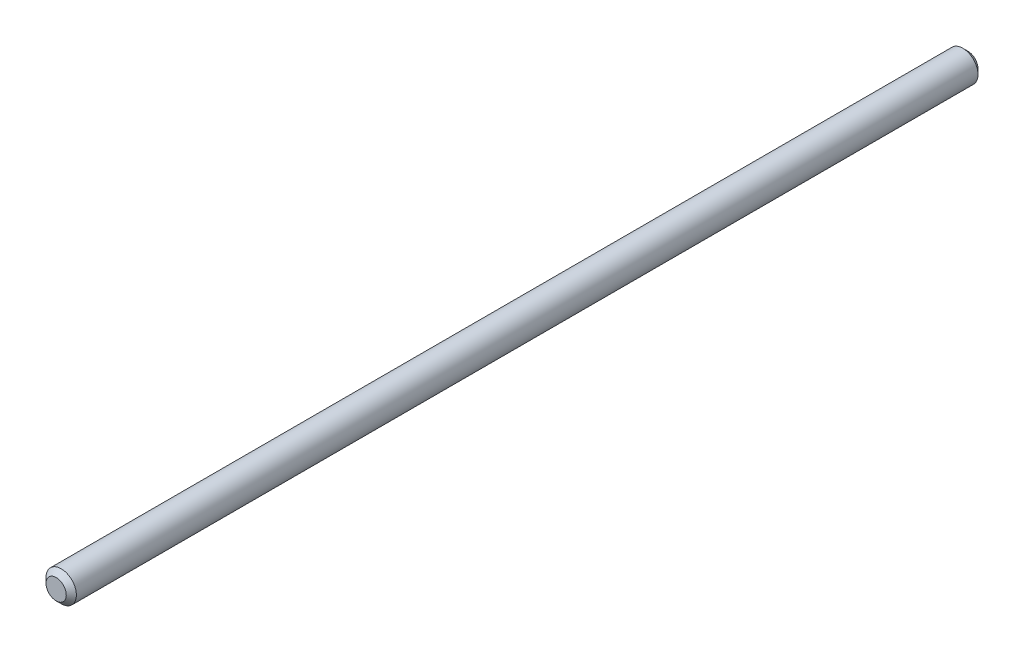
ISO-10303-21;
HEADER;
FILE_DESCRIPTION(('STEP AP214'),'2;1');
FILE_NAME('part.step','',(''),(''),'','','');
FILE_SCHEMA(('AUTOMOTIVE_DESIGN { 1 0 10303 214 1 1 1 1 }'));
ENDSEC;
DATA;
#1=APPLICATION_CONTEXT('core data for automotive mechanical design processes');
#2=APPLICATION_PROTOCOL_DEFINITION('international standard','automotive_design',2000,#1);
#3=PRODUCT_CONTEXT('',#1,'mechanical');
#4=PRODUCT('Part','Part','',(#3));
#5=PRODUCT_RELATED_PRODUCT_CATEGORY('part','',(#4));
#6=PRODUCT_DEFINITION_FORMATION('','',#4);
#7=PRODUCT_DEFINITION_CONTEXT('part definition',#1,'design');
#8=PRODUCT_DEFINITION('design','',#6,#7);
#9=PRODUCT_DEFINITION_SHAPE('','',#8);
#10=(LENGTH_UNIT() NAMED_UNIT(*) SI_UNIT(.MILLI.,.METRE.));
#11=(NAMED_UNIT(*) PLANE_ANGLE_UNIT() SI_UNIT($,.RADIAN.));
#12=(NAMED_UNIT(*) SI_UNIT($,.STERADIAN.) SOLID_ANGLE_UNIT());
#13=UNCERTAINTY_MEASURE_WITH_UNIT(LENGTH_MEASURE(1.E-05),#10,'distance_accuracy_value','');
#14=(GEOMETRIC_REPRESENTATION_CONTEXT(3) GLOBAL_UNCERTAINTY_ASSIGNED_CONTEXT((#13)) GLOBAL_UNIT_ASSIGNED_CONTEXT((#10,
#11,#12)) REPRESENTATION_CONTEXT('',''));
#15=CARTESIAN_POINT('',(0.,0.,0.));
#16=DIRECTION('',(0.,0.,1.));
#17=DIRECTION('',(1.,0.,0.));
#18=AXIS2_PLACEMENT_3D('',#15,#16,#17);
#19=CARTESIAN_POINT('',(0.,0.,90.));
#20=DIRECTION('',(0.,0.,-1.));
#21=DIRECTION('',(-1.,0.,0.));
#22=AXIS2_PLACEMENT_3D('',#19,#20,#21);
#23=CYLINDRICAL_SURFACE('',#22,1.5);
#24=CARTESIAN_POINT('',(0.,0.,89.5));
#25=DIRECTION('',(0.,0.,1.));
#26=DIRECTION('',(1.,0.,0.));
#27=AXIS2_PLACEMENT_3D('',#24,#25,#26);
#28=CIRCLE('',#27,1.5);
#29=CARTESIAN_POINT('',(-1.5,0.,89.5));
#30=VERTEX_POINT('',#29);
#31=EDGE_CURVE('E30',#30,#30,#28,.F.);
#32=CARTESIAN_POINT('',(0.,0.,0.500000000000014));
#33=DIRECTION('',(0.,0.,1.));
#34=DIRECTION('',(1.,0.,0.));
#35=AXIS2_PLACEMENT_3D('',#32,#33,#34);
#36=CIRCLE('',#35,1.5);
#37=CARTESIAN_POINT('',(-1.5,0.,0.500000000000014));
#38=VERTEX_POINT('',#37);
#39=EDGE_CURVE('E34',#38,#38,#36,.T.);
#40=CARTESIAN_POINT('',(-1.5,0.,89.5));
#41=CARTESIAN_POINT('',(-1.5,0.,88.5729166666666));
#42=CARTESIAN_POINT('',(-1.5,0.,87.6458333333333));
#43=CARTESIAN_POINT('',(-1.5,0.,85.7916666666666));
#44=CARTESIAN_POINT('',(-1.5,0.,84.8645833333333));
#45=CARTESIAN_POINT('',(-1.5,0.,83.0104166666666));
#46=CARTESIAN_POINT('',(-1.5,0.,82.0833333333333));
#47=CARTESIAN_POINT('',(-1.5,0.,80.2291666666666));
#48=CARTESIAN_POINT('',(-1.5,0.,79.3020833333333));
#49=CARTESIAN_POINT('',(-1.5,0.,77.4479166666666));
#50=CARTESIAN_POINT('',(-1.5,0.,76.5208333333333));
#51=CARTESIAN_POINT('',(-1.5,0.,74.6666666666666));
#52=CARTESIAN_POINT('',(-1.5,0.,73.7395833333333));
#53=CARTESIAN_POINT('',(-1.5,0.,71.8854166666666));
#54=CARTESIAN_POINT('',(-1.5,0.,70.9583333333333));
#55=CARTESIAN_POINT('',(-1.5,0.,69.1041666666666));
#56=CARTESIAN_POINT('',(-1.5,0.,68.1770833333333));
#57=CARTESIAN_POINT('',(-1.5,0.,66.3229166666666));
#58=CARTESIAN_POINT('',(-1.5,0.,65.3958333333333));
#59=CARTESIAN_POINT('',(-1.5,0.,63.5416666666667));
#60=CARTESIAN_POINT('',(-1.5,0.,62.6145833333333));
#61=CARTESIAN_POINT('',(-1.5,0.,60.7604166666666));
#62=CARTESIAN_POINT('',(-1.5,0.,59.8333333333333));
#63=CARTESIAN_POINT('',(-1.5,0.,57.9791666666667));
#64=CARTESIAN_POINT('',(-1.5,0.,57.0520833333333));
#65=CARTESIAN_POINT('',(-1.5,0.,55.1979166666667));
#66=CARTESIAN_POINT('',(-1.5,0.,54.2708333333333));
#67=CARTESIAN_POINT('',(-1.5,0.,52.4166666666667));
#68=CARTESIAN_POINT('',(-1.5,0.,51.4895833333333));
#69=CARTESIAN_POINT('',(-1.5,0.,49.6354166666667));
#70=CARTESIAN_POINT('',(-1.5,0.,48.7083333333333));
#71=CARTESIAN_POINT('',(-1.5,0.,46.8541666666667));
#72=CARTESIAN_POINT('',(-1.5,0.,45.9270833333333));
#73=CARTESIAN_POINT('',(-1.5,0.,44.0729166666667));
#74=CARTESIAN_POINT('',(-1.5,0.,43.1458333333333));
#75=CARTESIAN_POINT('',(-1.5,0.,41.2916666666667));
#76=CARTESIAN_POINT('',(-1.5,0.,40.3645833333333));
#77=CARTESIAN_POINT('',(-1.5,0.,38.5104166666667));
#78=CARTESIAN_POINT('',(-1.5,0.,37.5833333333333));
#79=CARTESIAN_POINT('',(-1.5,0.,35.7291666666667));
#80=CARTESIAN_POINT('',(-1.5,0.,34.8020833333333));
#81=CARTESIAN_POINT('',(-1.5,0.,32.9479166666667));
#82=CARTESIAN_POINT('',(-1.5,0.,32.0208333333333));
#83=CARTESIAN_POINT('',(-1.5,0.,30.1666666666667));
#84=CARTESIAN_POINT('',(-1.5,0.,29.2395833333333));
#85=CARTESIAN_POINT('',(-1.5,0.,27.3854166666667));
#86=CARTESIAN_POINT('',(-1.5,0.,26.4583333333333));
#87=CARTESIAN_POINT('',(-1.5,0.,24.6041666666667));
#88=CARTESIAN_POINT('',(-1.5,0.,23.6770833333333));
#89=CARTESIAN_POINT('',(-1.5,0.,21.8229166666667));
#90=CARTESIAN_POINT('',(-1.5,0.,20.8958333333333));
#91=CARTESIAN_POINT('',(-1.5,0.,19.0416666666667));
#92=CARTESIAN_POINT('',(-1.5,0.,18.1145833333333));
#93=CARTESIAN_POINT('',(-1.5,0.,16.2604166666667));
#94=CARTESIAN_POINT('',(-1.5,0.,15.3333333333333));
#95=CARTESIAN_POINT('',(-1.5,0.,13.4791666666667));
#96=CARTESIAN_POINT('',(-1.5,0.,12.5520833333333));
#97=CARTESIAN_POINT('',(-1.5,0.,10.6979166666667));
#98=CARTESIAN_POINT('',(-1.5,0.,9.77083333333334));
#99=CARTESIAN_POINT('',(-1.5,0.,7.91666666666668));
#100=CARTESIAN_POINT('',(-1.5,0.,6.98958333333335));
#101=CARTESIAN_POINT('',(-1.5,0.,5.13541666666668));
#102=CARTESIAN_POINT('',(-1.5,0.,4.20833333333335));
#103=CARTESIAN_POINT('',(-1.5,0.,2.35416666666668));
#104=CARTESIAN_POINT('',(-1.5,0.,1.42708333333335));
#105=CARTESIAN_POINT('',(-1.5,0.,0.500000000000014));
#106=B_SPLINE_CURVE_WITH_KNOTS('',3,(#40,#41,#42,#43,#44,#45,#46,#47,#48,#49,#50,#51,#52,#53,
#54,#55,#56,#57,#58,#59,#60,#61,#62,#63,#64,#65,#66,#67,#68,#69,#70,#71,#72,#73,#74,#75,#76,#77,
#78,#79,#80,#81,#82,#83,#84,#85,#86,#87,#88,#89,#90,#91,#92,#93,#94,#95,#96,#97,#98,#99,#100,
#101,#102,#103,#104,#105),.UNSPECIFIED.,.F.,.F.,(4,2,2,2,2,2,2,2,2,2,2,2,2,2,2,2,2,2,2,2,2,2,2,
2,2,2,2,2,2,2,2,2,4),(0.,2.78124999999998,5.56249999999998,8.34374999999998,11.125,13.90625,
16.6875,19.46875,22.25,25.03125,27.8125,30.59375,33.375,36.15625,38.9375,41.71875,44.5,47.28125,
50.0625,52.84375,55.625,58.40625,61.1875,63.96875,66.7499999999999,69.5312499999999,
72.3124999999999,75.0937499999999,77.8749999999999,80.6562499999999,83.4374999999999,
86.2187499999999,88.9999999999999),.UNSPECIFIED.);
#107=EDGE_CURVE('BSEAM24',#30,#38,#106,.T.);
#108=ORIENTED_EDGE('',*,*,#31,.T.);
#109=ORIENTED_EDGE('',*,*,#39,.T.);
#110=ORIENTED_EDGE('',*,*,#107,.T.);
#111=ORIENTED_EDGE('',*,*,#107,.F.);
#112=EDGE_LOOP('',(#108,#110,#109,#111));
#113=FACE_BOUND('',#112,.T.);
#114=ADVANCED_FACE('F24',(#113),#23,.T.);
#115=CARTESIAN_POINT('',(0.,0.,90.));
#116=DIRECTION('',(0.,0.,1.));
#117=DIRECTION('',(1.,0.,0.));
#118=AXIS2_PLACEMENT_3D('',#115,#116,#117);
#119=PLANE('',#118);
#120=CARTESIAN_POINT('',(0.,0.,90.));
#121=DIRECTION('',(0.,0.,1.));
#122=DIRECTION('',(1.,0.,0.));
#123=AXIS2_PLACEMENT_3D('',#120,#121,#122);
#124=CIRCLE('',#123,0.999999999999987);
#125=CARTESIAN_POINT('',(0.999999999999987,0.,90.));
#126=VERTEX_POINT('',#125);
#127=EDGE_CURVE('E38',#126,#126,#124,.T.);
#128=ORIENTED_EDGE('',*,*,#127,.T.);
#129=EDGE_LOOP('',(#128));
#130=FACE_BOUND('',#129,.T.);
#131=ADVANCED_FACE('F44',(#130),#119,.T.);
#132=CARTESIAN_POINT('',(0.,0.,0.));
#133=DIRECTION('',(0.,0.,1.));
#134=DIRECTION('',(1.,0.,0.));
#135=AXIS2_PLACEMENT_3D('',#132,#133,#134);
#136=PLANE('',#135);
#137=CARTESIAN_POINT('',(0.,0.,0.));
#138=DIRECTION('',(0.,0.,1.));
#139=DIRECTION('',(1.,0.,0.));
#140=AXIS2_PLACEMENT_3D('',#137,#138,#139);
#141=CIRCLE('',#140,0.999999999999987);
#142=CARTESIAN_POINT('',(0.999999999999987,0.,0.));
#143=VERTEX_POINT('',#142);
#144=EDGE_CURVE('E10',#143,#143,#141,.F.);
#145=ORIENTED_EDGE('',*,*,#144,.T.);
#146=EDGE_LOOP('',(#145));
#147=FACE_BOUND('',#146,.T.);
#148=ADVANCED_FACE('F49',(#147),#136,.F.);
#149=CARTESIAN_POINT('',(0.,0.,90.));
#150=DIRECTION('',(0.,0.,-1.));
#151=DIRECTION('',(-1.,0.,0.));
#152=AXIS2_PLACEMENT_3D('',#149,#150,#151);
#153=CONICAL_SURFACE('',#152,0.999999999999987,0.785398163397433);
#154=ORIENTED_EDGE('',*,*,#31,.F.);
#155=EDGE_LOOP('',(#154));
#156=FACE_BOUND('',#155,.T.);
#157=ORIENTED_EDGE('',*,*,#127,.F.);
#158=EDGE_LOOP('',(#157));
#159=FACE_BOUND('',#158,.T.);
#160=ADVANCED_FACE('F46',(#156,#159),#153,.T.);
#161=CARTESIAN_POINT('',(0.,0.,0.500000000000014));
#162=DIRECTION('',(0.,0.,1.));
#163=DIRECTION('',(1.,0.,0.));
#164=AXIS2_PLACEMENT_3D('',#161,#162,#163);
#165=CONICAL_SURFACE('',#164,1.5,0.785398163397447);
#166=ORIENTED_EDGE('',*,*,#144,.F.);
#167=EDGE_LOOP('',(#166));
#168=FACE_BOUND('',#167,.T.);
#169=ORIENTED_EDGE('',*,*,#39,.F.);
#170=EDGE_LOOP('',(#169));
#171=FACE_BOUND('',#170,.T.);
#172=ADVANCED_FACE('F48',(#168,#171),#165,.T.);
#173=CLOSED_SHELL('',(#114,#131,#148,#160,#172));
#174=MANIFOLD_SOLID_BREP('B2',#173);
#175=ADVANCED_BREP_SHAPE_REPRESENTATION('',(#18,#174),#14);
#176=SHAPE_DEFINITION_REPRESENTATION(#9,#175);
ENDSEC;
END-ISO-10303-21;
